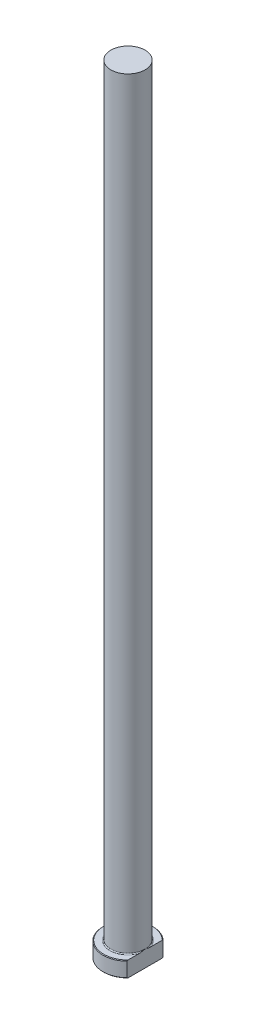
from build123d import *
from build123d.topology import SkipClean

# Parameters (mm, degrees)
CHAMFER1_SIZE = 0.2
FILLET1_R     = 0.3
KEY_DEPTH     = 251.255869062


with BuildPart() as part:
    # Sketch1 → Revolve1 (revolve)
    with BuildSketch(Plane.XY, mode=Mode.PRIVATE) as revolve1_sk:
        Polygon((0, 0), (-8, 0), (-8, 5), (-5.5, 5), (-5.5, 250), (0, 250), align=None)
    revolve(revolve1_sk.sketch.rotate(Axis((0, 259.958771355, 0), (0, -1, 0)), 270), axis=Axis((0, 259.958771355, 0), (0, -1, 0)))

    # Chamfer1
    chamfer1_edges = [part.edges().sort_by_distance(p)[0] for p in [
        (0, 5, -8),
        (0, 0, -8),
    ]]
    chamfer(chamfer1_edges, length=CHAMFER1_SIZE)

    # Fillet1
    fillet1_edges = [part.edges().sort_by_distance(p)[0] for p in [
        (0, 5, -5.5),
    ]]
    fillet(fillet1_edges, radius=FILLET1_R)

    # Sketch2 → KEY (cut, through all)
    with SkipClean():  # the faces are left unmerged after this step: merging them gives an invalid solid
        with BuildSketch(Plane(origin=(0, 0, 0), x_dir=(1, 0, 0), z_dir=(0, 1, 0))):
            with BuildLine():
                Line((5.5, 5.809475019), (5.5, -5.809475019))
                ThreePointArc((5.5, -5.809475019), (8, 0), (5.5, 5.809475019))
            make_face()
        extrude(amount=KEY_DEPTH, mode=Mode.SUBTRACT)


solid = part.part
